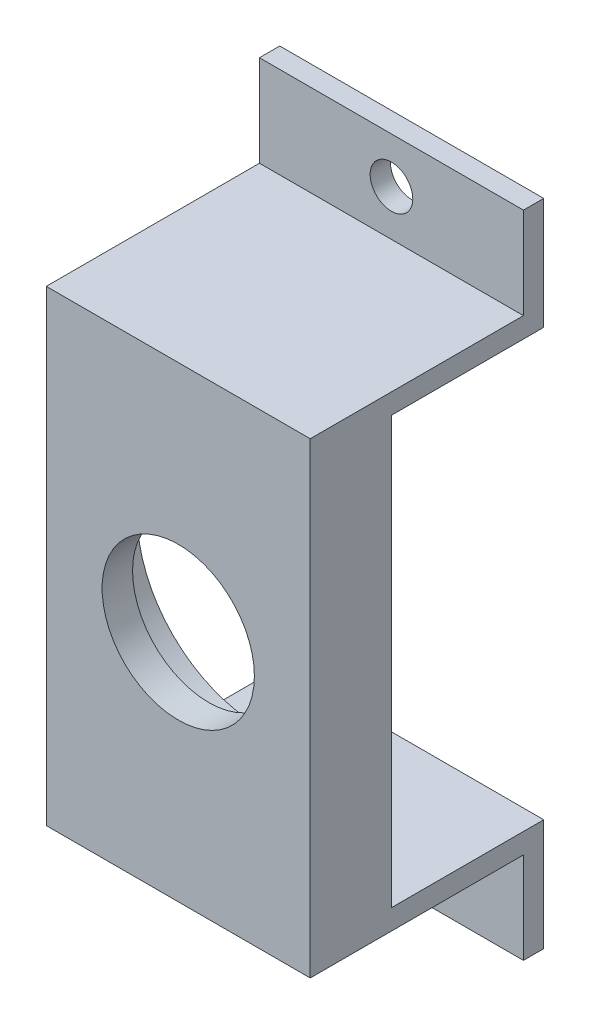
ISO-10303-21;
HEADER;
FILE_DESCRIPTION(('STEP AP214'),'2;1');
FILE_NAME('part.step','',(''),(''),'','','');
FILE_SCHEMA(('AUTOMOTIVE_DESIGN { 1 0 10303 214 1 1 1 1 }'));
ENDSEC;
DATA;
#1=APPLICATION_CONTEXT('core data for automotive mechanical design processes');
#2=APPLICATION_PROTOCOL_DEFINITION('international standard','automotive_design',2000,#1);
#3=PRODUCT_CONTEXT('',#1,'mechanical');
#4=PRODUCT('Part','Part','',(#3));
#5=PRODUCT_RELATED_PRODUCT_CATEGORY('part','',(#4));
#6=PRODUCT_DEFINITION_FORMATION('','',#4);
#7=PRODUCT_DEFINITION_CONTEXT('part definition',#1,'design');
#8=PRODUCT_DEFINITION('design','',#6,#7);
#9=PRODUCT_DEFINITION_SHAPE('','',#8);
#10=(LENGTH_UNIT() NAMED_UNIT(*) SI_UNIT(.MILLI.,.METRE.));
#11=(NAMED_UNIT(*) PLANE_ANGLE_UNIT() SI_UNIT($,.RADIAN.));
#12=(NAMED_UNIT(*) SI_UNIT($,.STERADIAN.) SOLID_ANGLE_UNIT());
#13=UNCERTAINTY_MEASURE_WITH_UNIT(LENGTH_MEASURE(1.E-05),#10,'distance_accuracy_value','');
#14=(GEOMETRIC_REPRESENTATION_CONTEXT(3) GLOBAL_UNCERTAINTY_ASSIGNED_CONTEXT((#13)) GLOBAL_UNIT_ASSIGNED_CONTEXT((#10,
#11,#12)) REPRESENTATION_CONTEXT('',''));
#15=CARTESIAN_POINT('',(0.,0.,0.));
#16=DIRECTION('',(0.,0.,1.));
#17=DIRECTION('',(1.,0.,0.));
#18=AXIS2_PLACEMENT_3D('',#15,#16,#17);
#19=CARTESIAN_POINT('',(0.,0.,17.));
#20=DIRECTION('',(0.,0.,1.));
#21=DIRECTION('',(1.,0.,0.));
#22=AXIS2_PLACEMENT_3D('',#19,#20,#21);
#23=PLANE('',#22);
#24=CARTESIAN_POINT('',(0.,0.,17.));
#25=DIRECTION('',(0.,0.,-1.));
#26=DIRECTION('',(-1.,0.,0.));
#27=AXIS2_PLACEMENT_3D('',#24,#25,#26);
#28=CIRCLE('',#27,12.05);
#29=CARTESIAN_POINT('',(-12.05,0.,17.));
#30=VERTEX_POINT('',#29);
#31=EDGE_CURVE('E156',#30,#30,#28,.T.);
#32=ORIENTED_EDGE('',*,*,#31,.F.);
#33=EDGE_LOOP('',(#32));
#34=FACE_BOUND('',#33,.T.);
#35=DIRECTION('',(0.,1.,0.));
#36=VECTOR('',#35,1.);
#37=CARTESIAN_POINT('',(13.,-21.,17.));
#38=LINE('',#37,#36);
#39=CARTESIAN_POINT('',(13.,-21.,17.));
#40=VERTEX_POINT('',#39);
#41=CARTESIAN_POINT('',(13.,21.,17.));
#42=VERTEX_POINT('',#41);
#43=EDGE_CURVE('E175',#40,#42,#38,.T.);
#44=ORIENTED_EDGE('',*,*,#43,.F.);
#45=DIRECTION('',(1.,0.,0.));
#46=VECTOR('',#45,1.);
#47=CARTESIAN_POINT('',(15.,-21.,17.));
#48=LINE('',#47,#46);
#49=CARTESIAN_POINT('',(-13.,-21.,17.));
#50=VERTEX_POINT('',#49);
#51=EDGE_CURVE('E178',#50,#40,#48,.T.);
#52=ORIENTED_EDGE('',*,*,#51,.F.);
#53=DIRECTION('',(0.,-1.,0.));
#54=VECTOR('',#53,1.);
#55=CARTESIAN_POINT('',(-13.,21.,17.));
#56=LINE('',#55,#54);
#57=CARTESIAN_POINT('',(-13.,21.,17.));
#58=VERTEX_POINT('',#57);
#59=EDGE_CURVE('E230',#58,#50,#56,.T.);
#60=ORIENTED_EDGE('',*,*,#59,.F.);
#61=DIRECTION('',(-1.,0.,0.));
#62=VECTOR('',#61,1.);
#63=CARTESIAN_POINT('',(15.,21.,17.));
#64=LINE('',#63,#62);
#65=EDGE_CURVE('E158',#42,#58,#64,.T.);
#66=ORIENTED_EDGE('',*,*,#65,.F.);
#67=EDGE_LOOP('',(#44,#52,#60,#66));
#68=FACE_BOUND('',#67,.T.);
#69=ADVANCED_FACE('F43',(#34,#68),#23,.F.);
#70=CARTESIAN_POINT('',(0.,0.,25.));
#71=DIRECTION('',(0.,0.,1.));
#72=DIRECTION('',(1.,0.,0.));
#73=AXIS2_PLACEMENT_3D('',#70,#71,#72);
#74=PLANE('',#73);
#75=CARTESIAN_POINT('',(0.,0.,25.));
#76=DIRECTION('',(0.,0.,1.));
#77=DIRECTION('',(1.,0.,0.));
#78=AXIS2_PLACEMENT_3D('',#75,#76,#77);
#79=CIRCLE('',#78,7.5);
#80=CARTESIAN_POINT('',(7.5,0.,25.));
#81=VERTEX_POINT('',#80);
#82=EDGE_CURVE('E11',#81,#81,#79,.T.);
#83=ORIENTED_EDGE('',*,*,#82,.F.);
#84=EDGE_LOOP('',(#83));
#85=FACE_BOUND('',#84,.T.);
#86=DIRECTION('',(-1.,0.,0.));
#87=VECTOR('',#86,1.);
#88=CARTESIAN_POINT('',(15.,-23.,25.));
#89=LINE('',#88,#87);
#90=CARTESIAN_POINT('',(13.,-23.,25.));
#91=VERTEX_POINT('',#90);
#92=CARTESIAN_POINT('',(-13.,-23.,25.));
#93=VERTEX_POINT('',#92);
#94=EDGE_CURVE('E148',#91,#93,#89,.T.);
#95=ORIENTED_EDGE('',*,*,#94,.F.);
#96=DIRECTION('',(0.,-1.,0.));
#97=VECTOR('',#96,1.);
#98=CARTESIAN_POINT('',(13.,23.,25.));
#99=LINE('',#98,#97);
#100=CARTESIAN_POINT('',(13.,23.,25.));
#101=VERTEX_POINT('',#100);
#102=EDGE_CURVE('E133',#101,#91,#99,.T.);
#103=ORIENTED_EDGE('',*,*,#102,.F.);
#104=DIRECTION('',(1.,0.,0.));
#105=VECTOR('',#104,1.);
#106=CARTESIAN_POINT('',(-15.,23.,25.));
#107=LINE('',#106,#105);
#108=CARTESIAN_POINT('',(-13.,23.,25.));
#109=VERTEX_POINT('',#108);
#110=EDGE_CURVE('E147',#109,#101,#107,.T.);
#111=ORIENTED_EDGE('',*,*,#110,.F.);
#112=DIRECTION('',(0.,1.,0.));
#113=VECTOR('',#112,1.);
#114=CARTESIAN_POINT('',(-13.,-23.,25.));
#115=LINE('',#114,#113);
#116=EDGE_CURVE('E244',#93,#109,#115,.T.);
#117=ORIENTED_EDGE('',*,*,#116,.F.);
#118=EDGE_LOOP('',(#95,#103,#111,#117));
#119=FACE_BOUND('',#118,.T.);
#120=ADVANCED_FACE('F145',(#85,#119),#74,.T.);
#121=CARTESIAN_POINT('',(0.,-23.,0.));
#122=DIRECTION('',(0.,-1.,0.));
#123=DIRECTION('',(0.,0.,-1.));
#124=AXIS2_PLACEMENT_3D('',#121,#122,#123);
#125=PLANE('',#124);
#126=DIRECTION('',(-1.,0.,0.));
#127=VECTOR('',#126,1.);
#128=CARTESIAN_POINT('',(-15.,-23.,4.));
#129=LINE('',#128,#127);
#130=CARTESIAN_POINT('',(13.,-23.,4.));
#131=VERTEX_POINT('',#130);
#132=CARTESIAN_POINT('',(-13.,-23.,4.));
#133=VERTEX_POINT('',#132);
#134=EDGE_CURVE('E202',#131,#133,#129,.T.);
#135=ORIENTED_EDGE('',*,*,#134,.F.);
#136=DIRECTION('',(0.,0.,-1.));
#137=VECTOR('',#136,1.);
#138=CARTESIAN_POINT('',(13.,-23.,25.));
#139=LINE('',#138,#137);
#140=EDGE_CURVE('E149',#91,#131,#139,.T.);
#141=ORIENTED_EDGE('',*,*,#140,.F.);
#142=ORIENTED_EDGE('',*,*,#94,.T.);
#143=DIRECTION('',(0.,0.,1.));
#144=VECTOR('',#143,1.);
#145=CARTESIAN_POINT('',(-13.,-23.,4.));
#146=LINE('',#145,#144);
#147=EDGE_CURVE('E220',#133,#93,#146,.T.);
#148=ORIENTED_EDGE('',*,*,#147,.F.);
#149=EDGE_LOOP('',(#135,#141,#142,#148));
#150=FACE_BOUND('',#149,.T.);
#151=ADVANCED_FACE('F265',(#150),#125,.T.);
#152=CARTESIAN_POINT('',(0.,23.,0.));
#153=DIRECTION('',(0.,1.,0.));
#154=DIRECTION('',(0.,0.,1.));
#155=AXIS2_PLACEMENT_3D('',#152,#153,#154);
#156=PLANE('',#155);
#157=ORIENTED_EDGE('',*,*,#110,.T.);
#158=DIRECTION('',(0.,0.,1.));
#159=VECTOR('',#158,1.);
#160=CARTESIAN_POINT('',(13.,23.,4.));
#161=LINE('',#160,#159);
#162=CARTESIAN_POINT('',(13.,23.,4.));
#163=VERTEX_POINT('',#162);
#164=EDGE_CURVE('E130',#163,#101,#161,.T.);
#165=ORIENTED_EDGE('',*,*,#164,.F.);
#166=DIRECTION('',(1.,0.,0.));
#167=VECTOR('',#166,1.);
#168=CARTESIAN_POINT('',(-15.,23.,4.));
#169=LINE('',#168,#167);
#170=CARTESIAN_POINT('',(-13.,23.,4.));
#171=VERTEX_POINT('',#170);
#172=EDGE_CURVE('E195',#171,#163,#169,.T.);
#173=ORIENTED_EDGE('',*,*,#172,.F.);
#174=DIRECTION('',(0.,0.,-1.));
#175=VECTOR('',#174,1.);
#176=CARTESIAN_POINT('',(-13.,23.,25.));
#177=LINE('',#176,#175);
#178=EDGE_CURVE('E153',#109,#171,#177,.T.);
#179=ORIENTED_EDGE('',*,*,#178,.F.);
#180=EDGE_LOOP('',(#157,#165,#173,#179));
#181=FACE_BOUND('',#180,.T.);
#182=ADVANCED_FACE('F152',(#181),#156,.T.);
#183=CARTESIAN_POINT('',(15.,21.,2.));
#184=DIRECTION('',(0.,1.,0.));
#185=DIRECTION('',(0.,0.,1.));
#186=AXIS2_PLACEMENT_3D('',#183,#184,#185);
#187=PLANE('',#186);
#188=DIRECTION('',(0.,0.,-1.));
#189=VECTOR('',#188,1.);
#190=CARTESIAN_POINT('',(13.,21.,17.));
#191=LINE('',#190,#189);
#192=CARTESIAN_POINT('',(13.,21.,2.));
#193=VERTEX_POINT('',#192);
#194=EDGE_CURVE('E180',#42,#193,#191,.T.);
#195=ORIENTED_EDGE('',*,*,#194,.F.);
#196=ORIENTED_EDGE('',*,*,#65,.T.);
#197=DIRECTION('',(0.,0.,1.));
#198=VECTOR('',#197,1.);
#199=CARTESIAN_POINT('',(-13.,21.,2.));
#200=LINE('',#199,#198);
#201=CARTESIAN_POINT('',(-13.,21.,2.));
#202=VERTEX_POINT('',#201);
#203=EDGE_CURVE('E232',#202,#58,#200,.T.);
#204=ORIENTED_EDGE('',*,*,#203,.F.);
#205=DIRECTION('',(-1.,0.,0.));
#206=VECTOR('',#205,1.);
#207=CARTESIAN_POINT('',(15.,21.,2.));
#208=LINE('',#207,#206);
#209=EDGE_CURVE('E154',#193,#202,#208,.T.);
#210=ORIENTED_EDGE('',*,*,#209,.F.);
#211=EDGE_LOOP('',(#195,#196,#204,#210));
#212=FACE_BOUND('',#211,.T.);
#213=ADVANCED_FACE('F289',(#212),#187,.F.);
#214=CARTESIAN_POINT('',(0.,0.,2.));
#215=DIRECTION('',(0.,0.,-1.));
#216=DIRECTION('',(-1.,0.,0.));
#217=AXIS2_PLACEMENT_3D('',#214,#215,#216);
#218=PLANE('',#217);
#219=CARTESIAN_POINT('',(0.,27.5,2.));
#220=DIRECTION('',(0.,0.,1.));
#221=DIRECTION('',(1.,0.,0.));
#222=AXIS2_PLACEMENT_3D('',#219,#220,#221);
#223=CIRCLE('',#222,2.1);
#224=CARTESIAN_POINT('',(2.1,27.5,2.));
#225=VERTEX_POINT('',#224);
#226=EDGE_CURVE('E214',#225,#225,#223,.T.);
#227=ORIENTED_EDGE('',*,*,#226,.T.);
#228=EDGE_LOOP('',(#227));
#229=FACE_BOUND('',#228,.T.);
#230=DIRECTION('',(-1.,0.,0.));
#231=VECTOR('',#230,1.);
#232=CARTESIAN_POINT('',(-15.,32.,2.));
#233=LINE('',#232,#231);
#234=CARTESIAN_POINT('',(13.,32.,2.));
#235=VERTEX_POINT('',#234);
#236=CARTESIAN_POINT('',(-13.,32.,2.));
#237=VERTEX_POINT('',#236);
#238=EDGE_CURVE('E192',#235,#237,#233,.T.);
#239=ORIENTED_EDGE('',*,*,#238,.F.);
#240=DIRECTION('',(0.,1.,0.));
#241=VECTOR('',#240,1.);
#242=CARTESIAN_POINT('',(13.,21.,2.));
#243=LINE('',#242,#241);
#244=EDGE_CURVE('E249',#193,#235,#243,.T.);
#245=ORIENTED_EDGE('',*,*,#244,.F.);
#246=ORIENTED_EDGE('',*,*,#209,.T.);
#247=DIRECTION('',(0.,-1.,0.));
#248=VECTOR('',#247,1.);
#249=CARTESIAN_POINT('',(-13.,32.,2.));
#250=LINE('',#249,#248);
#251=EDGE_CURVE('E235',#237,#202,#250,.T.);
#252=ORIENTED_EDGE('',*,*,#251,.F.);
#253=EDGE_LOOP('',(#239,#245,#246,#252));
#254=FACE_BOUND('',#253,.T.);
#255=ADVANCED_FACE('F284',(#229,#254),#218,.T.);
#256=CARTESIAN_POINT('',(15.,-21.,2.));
#257=DIRECTION('',(0.,-1.,0.));
#258=DIRECTION('',(0.,0.,-1.));
#259=AXIS2_PLACEMENT_3D('',#256,#257,#258);
#260=PLANE('',#259);
#261=DIRECTION('',(0.,0.,1.));
#262=VECTOR('',#261,1.);
#263=CARTESIAN_POINT('',(13.,-21.,2.));
#264=LINE('',#263,#262);
#265=CARTESIAN_POINT('',(13.,-21.,2.));
#266=VERTEX_POINT('',#265);
#267=EDGE_CURVE('E181',#266,#40,#264,.T.);
#268=ORIENTED_EDGE('',*,*,#267,.F.);
#269=DIRECTION('',(1.,0.,0.));
#270=VECTOR('',#269,1.);
#271=CARTESIAN_POINT('',(15.,-21.,2.));
#272=LINE('',#271,#270);
#273=CARTESIAN_POINT('',(-13.,-21.,2.));
#274=VERTEX_POINT('',#273);
#275=EDGE_CURVE('E190',#274,#266,#272,.T.);
#276=ORIENTED_EDGE('',*,*,#275,.F.);
#277=DIRECTION('',(0.,0.,-1.));
#278=VECTOR('',#277,1.);
#279=CARTESIAN_POINT('',(-13.,-21.,17.));
#280=LINE('',#279,#278);
#281=EDGE_CURVE('E189',#50,#274,#280,.T.);
#282=ORIENTED_EDGE('',*,*,#281,.F.);
#283=ORIENTED_EDGE('',*,*,#51,.T.);
#284=EDGE_LOOP('',(#268,#276,#282,#283));
#285=FACE_BOUND('',#284,.T.);
#286=ADVANCED_FACE('F186',(#285),#260,.F.);
#287=CARTESIAN_POINT('',(0.,0.,2.));
#288=DIRECTION('',(0.,0.,-1.));
#289=DIRECTION('',(-1.,0.,0.));
#290=AXIS2_PLACEMENT_3D('',#287,#288,#289);
#291=PLANE('',#290);
#292=CARTESIAN_POINT('',(0.,-27.5,2.));
#293=DIRECTION('',(0.,0.,1.));
#294=DIRECTION('',(1.,0.,0.));
#295=AXIS2_PLACEMENT_3D('',#292,#293,#294);
#296=CIRCLE('',#295,2.1);
#297=CARTESIAN_POINT('',(2.1,-27.5,2.));
#298=VERTEX_POINT('',#297);
#299=EDGE_CURVE('E205',#298,#298,#296,.T.);
#300=ORIENTED_EDGE('',*,*,#299,.T.);
#301=EDGE_LOOP('',(#300));
#302=FACE_BOUND('',#301,.T.);
#303=ORIENTED_EDGE('',*,*,#275,.T.);
#304=DIRECTION('',(0.,1.,0.));
#305=VECTOR('',#304,1.);
#306=CARTESIAN_POINT('',(13.,-32.,2.));
#307=LINE('',#306,#305);
#308=CARTESIAN_POINT('',(13.,-32.,2.));
#309=VERTEX_POINT('',#308);
#310=EDGE_CURVE('E253',#309,#266,#307,.T.);
#311=ORIENTED_EDGE('',*,*,#310,.F.);
#312=DIRECTION('',(1.,0.,0.));
#313=VECTOR('',#312,1.);
#314=CARTESIAN_POINT('',(-15.,-32.,2.));
#315=LINE('',#314,#313);
#316=CARTESIAN_POINT('',(-13.,-32.,2.));
#317=VERTEX_POINT('',#316);
#318=EDGE_CURVE('E204',#317,#309,#315,.T.);
#319=ORIENTED_EDGE('',*,*,#318,.F.);
#320=DIRECTION('',(0.,-1.,0.));
#321=VECTOR('',#320,1.);
#322=CARTESIAN_POINT('',(-13.,-21.,2.));
#323=LINE('',#322,#321);
#324=EDGE_CURVE('E65',#274,#317,#323,.T.);
#325=ORIENTED_EDGE('',*,*,#324,.F.);
#326=EDGE_LOOP('',(#303,#311,#319,#325));
#327=FACE_BOUND('',#326,.T.);
#328=ADVANCED_FACE('F272',(#302,#327),#291,.T.);
#329=CARTESIAN_POINT('',(-15.,32.,4.));
#330=DIRECTION('',(0.,0.,-1.));
#331=DIRECTION('',(-1.,0.,0.));
#332=AXIS2_PLACEMENT_3D('',#329,#330,#331);
#333=PLANE('',#332);
#334=CARTESIAN_POINT('',(0.,27.5,4.));
#335=DIRECTION('',(0.,0.,1.));
#336=DIRECTION('',(1.,0.,0.));
#337=AXIS2_PLACEMENT_3D('',#334,#335,#336);
#338=CIRCLE('',#337,2.09999999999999);
#339=CARTESIAN_POINT('',(2.09999999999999,27.5,4.));
#340=VERTEX_POINT('',#339);
#341=EDGE_CURVE('E217',#340,#340,#338,.T.);
#342=ORIENTED_EDGE('',*,*,#341,.F.);
#343=EDGE_LOOP('',(#342));
#344=FACE_BOUND('',#343,.T.);
#345=DIRECTION('',(0.,-1.,0.));
#346=VECTOR('',#345,1.);
#347=CARTESIAN_POINT('',(13.,32.,4.));
#348=LINE('',#347,#346);
#349=CARTESIAN_POINT('',(13.,32.,4.));
#350=VERTEX_POINT('',#349);
#351=EDGE_CURVE('E136',#350,#163,#348,.T.);
#352=ORIENTED_EDGE('',*,*,#351,.F.);
#353=DIRECTION('',(1.,0.,0.));
#354=VECTOR('',#353,1.);
#355=CARTESIAN_POINT('',(-15.,32.,4.));
#356=LINE('',#355,#354);
#357=CARTESIAN_POINT('',(-13.,32.,4.));
#358=VERTEX_POINT('',#357);
#359=EDGE_CURVE('E197',#358,#350,#356,.T.);
#360=ORIENTED_EDGE('',*,*,#359,.F.);
#361=DIRECTION('',(0.,1.,0.));
#362=VECTOR('',#361,1.);
#363=CARTESIAN_POINT('',(-13.,23.,4.));
#364=LINE('',#363,#362);
#365=EDGE_CURVE('E241',#171,#358,#364,.T.);
#366=ORIENTED_EDGE('',*,*,#365,.F.);
#367=ORIENTED_EDGE('',*,*,#172,.T.);
#368=EDGE_LOOP('',(#352,#360,#366,#367));
#369=FACE_BOUND('',#368,.T.);
#370=ADVANCED_FACE('F274',(#344,#369),#333,.F.);
#371=CARTESIAN_POINT('',(0.,32.,0.));
#372=DIRECTION('',(0.,1.,0.));
#373=DIRECTION('',(0.,0.,1.));
#374=AXIS2_PLACEMENT_3D('',#371,#372,#373);
#375=PLANE('',#374);
#376=ORIENTED_EDGE('',*,*,#359,.T.);
#377=DIRECTION('',(0.,0.,1.));
#378=VECTOR('',#377,1.);
#379=CARTESIAN_POINT('',(13.,32.,2.));
#380=LINE('',#379,#378);
#381=EDGE_CURVE('E247',#235,#350,#380,.T.);
#382=ORIENTED_EDGE('',*,*,#381,.F.);
#383=ORIENTED_EDGE('',*,*,#238,.T.);
#384=DIRECTION('',(0.,0.,-1.));
#385=VECTOR('',#384,1.);
#386=CARTESIAN_POINT('',(-13.,32.,4.));
#387=LINE('',#386,#385);
#388=EDGE_CURVE('E238',#358,#237,#387,.T.);
#389=ORIENTED_EDGE('',*,*,#388,.F.);
#390=EDGE_LOOP('',(#376,#382,#383,#389));
#391=FACE_BOUND('',#390,.T.);
#392=ADVANCED_FACE('F281',(#391),#375,.T.);
#393=CARTESIAN_POINT('',(-15.,-32.,4.));
#394=DIRECTION('',(0.,0.,-1.));
#395=DIRECTION('',(-1.,0.,0.));
#396=AXIS2_PLACEMENT_3D('',#393,#394,#395);
#397=PLANE('',#396);
#398=CARTESIAN_POINT('',(0.,-27.5,4.));
#399=DIRECTION('',(0.,0.,1.));
#400=DIRECTION('',(1.,0.,0.));
#401=AXIS2_PLACEMENT_3D('',#398,#399,#400);
#402=CIRCLE('',#401,2.09999999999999);
#403=CARTESIAN_POINT('',(2.09999999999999,-27.5,4.));
#404=VERTEX_POINT('',#403);
#405=EDGE_CURVE('E211',#404,#404,#402,.T.);
#406=ORIENTED_EDGE('',*,*,#405,.F.);
#407=EDGE_LOOP('',(#406));
#408=FACE_BOUND('',#407,.T.);
#409=DIRECTION('',(0.,-1.,0.));
#410=VECTOR('',#409,1.);
#411=CARTESIAN_POINT('',(13.,-23.,4.));
#412=LINE('',#411,#410);
#413=CARTESIAN_POINT('',(13.,-32.,4.));
#414=VERTEX_POINT('',#413);
#415=EDGE_CURVE('E57',#131,#414,#412,.T.);
#416=ORIENTED_EDGE('',*,*,#415,.F.);
#417=ORIENTED_EDGE('',*,*,#134,.T.);
#418=DIRECTION('',(0.,1.,0.));
#419=VECTOR('',#418,1.);
#420=CARTESIAN_POINT('',(-13.,-32.,4.));
#421=LINE('',#420,#419);
#422=CARTESIAN_POINT('',(-13.,-32.,4.));
#423=VERTEX_POINT('',#422);
#424=EDGE_CURVE('E223',#423,#133,#421,.T.);
#425=ORIENTED_EDGE('',*,*,#424,.F.);
#426=DIRECTION('',(-1.,0.,0.));
#427=VECTOR('',#426,1.);
#428=CARTESIAN_POINT('',(-15.,-32.,4.));
#429=LINE('',#428,#427);
#430=EDGE_CURVE('E198',#414,#423,#429,.T.);
#431=ORIENTED_EDGE('',*,*,#430,.F.);
#432=EDGE_LOOP('',(#416,#417,#425,#431));
#433=FACE_BOUND('',#432,.T.);
#434=ADVANCED_FACE('F262',(#408,#433),#397,.F.);
#435=CARTESIAN_POINT('',(0.,-32.,0.));
#436=DIRECTION('',(0.,-1.,0.));
#437=DIRECTION('',(0.,0.,-1.));
#438=AXIS2_PLACEMENT_3D('',#435,#436,#437);
#439=PLANE('',#438);
#440=ORIENTED_EDGE('',*,*,#318,.T.);
#441=DIRECTION('',(0.,0.,-1.));
#442=VECTOR('',#441,1.);
#443=CARTESIAN_POINT('',(13.,-32.,4.));
#444=LINE('',#443,#442);
#445=EDGE_CURVE('E255',#414,#309,#444,.T.);
#446=ORIENTED_EDGE('',*,*,#445,.F.);
#447=ORIENTED_EDGE('',*,*,#430,.T.);
#448=DIRECTION('',(0.,0.,1.));
#449=VECTOR('',#448,1.);
#450=CARTESIAN_POINT('',(-13.,-32.,2.));
#451=LINE('',#450,#449);
#452=EDGE_CURVE('E226',#317,#423,#451,.T.);
#453=ORIENTED_EDGE('',*,*,#452,.F.);
#454=EDGE_LOOP('',(#440,#446,#447,#453));
#455=FACE_BOUND('',#454,.T.);
#456=ADVANCED_FACE('F269',(#455),#439,.T.);
#457=CARTESIAN_POINT('',(0.,0.,17.));
#458=DIRECTION('',(0.,0.,1.));
#459=DIRECTION('',(1.,0.,0.));
#460=AXIS2_PLACEMENT_3D('',#457,#458,#459);
#461=CYLINDRICAL_SURFACE('',#460,7.5);
#462=ORIENTED_EDGE('',*,*,#82,.T.);
#463=EDGE_LOOP('',(#462));
#464=FACE_BOUND('',#463,.T.);
#465=CARTESIAN_POINT('',(0.,0.,22.));
#466=DIRECTION('',(0.,0.,-1.));
#467=DIRECTION('',(-1.,0.,0.));
#468=AXIS2_PLACEMENT_3D('',#465,#466,#467);
#469=CIRCLE('',#468,7.5);
#470=CARTESIAN_POINT('',(-7.5,0.,22.));
#471=VERTEX_POINT('',#470);
#472=EDGE_CURVE('E46',#471,#471,#469,.F.);
#473=ORIENTED_EDGE('',*,*,#472,.F.);
#474=EDGE_LOOP('',(#473));
#475=FACE_BOUND('',#474,.T.);
#476=ADVANCED_FACE('F301',(#464,#475),#461,.F.);
#477=CARTESIAN_POINT('',(0.,0.,22.));
#478=DIRECTION('',(0.,0.,-1.));
#479=DIRECTION('',(-1.,0.,0.));
#480=AXIS2_PLACEMENT_3D('',#477,#478,#479);
#481=PLANE('',#480);
#482=CARTESIAN_POINT('',(0.,0.,22.));
#483=DIRECTION('',(0.,0.,-1.));
#484=DIRECTION('',(-1.,0.,0.));
#485=AXIS2_PLACEMENT_3D('',#482,#483,#484);
#486=CIRCLE('',#485,12.05);
#487=CARTESIAN_POINT('',(-12.05,0.,22.));
#488=VERTEX_POINT('',#487);
#489=EDGE_CURVE('E162',#488,#488,#486,.T.);
#490=ORIENTED_EDGE('',*,*,#489,.T.);
#491=EDGE_LOOP('',(#490));
#492=FACE_BOUND('',#491,.T.);
#493=ORIENTED_EDGE('',*,*,#472,.T.);
#494=EDGE_LOOP('',(#493));
#495=FACE_BOUND('',#494,.T.);
#496=ADVANCED_FACE('F298',(#492,#495),#481,.T.);
#497=CARTESIAN_POINT('',(0.,0.,22.));
#498=DIRECTION('',(0.,0.,-1.));
#499=DIRECTION('',(-1.,0.,0.));
#500=AXIS2_PLACEMENT_3D('',#497,#498,#499);
#501=CYLINDRICAL_SURFACE('',#500,12.05);
#502=ORIENTED_EDGE('',*,*,#489,.F.);
#503=EDGE_LOOP('',(#502));
#504=FACE_BOUND('',#503,.T.);
#505=ORIENTED_EDGE('',*,*,#31,.T.);
#506=EDGE_LOOP('',(#505));
#507=FACE_BOUND('',#506,.T.);
#508=ADVANCED_FACE('F168',(#504,#507),#501,.F.);
#509=CARTESIAN_POINT('',(0.,-27.5,4.));
#510=DIRECTION('',(0.,0.,1.));
#511=DIRECTION('',(1.,0.,0.));
#512=AXIS2_PLACEMENT_3D('',#509,#510,#511);
#513=CYLINDRICAL_SURFACE('',#512,2.09999999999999);
#514=ORIENTED_EDGE('',*,*,#299,.F.);
#515=EDGE_LOOP('',(#514));
#516=FACE_BOUND('',#515,.T.);
#517=ORIENTED_EDGE('',*,*,#405,.T.);
#518=EDGE_LOOP('',(#517));
#519=FACE_BOUND('',#518,.T.);
#520=ADVANCED_FACE('F305',(#516,#519),#513,.F.);
#521=CARTESIAN_POINT('',(0.,27.5,4.));
#522=DIRECTION('',(0.,0.,1.));
#523=DIRECTION('',(1.,0.,0.));
#524=AXIS2_PLACEMENT_3D('',#521,#522,#523);
#525=CYLINDRICAL_SURFACE('',#524,2.09999999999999);
#526=ORIENTED_EDGE('',*,*,#226,.F.);
#527=EDGE_LOOP('',(#526));
#528=FACE_BOUND('',#527,.T.);
#529=ORIENTED_EDGE('',*,*,#341,.T.);
#530=EDGE_LOOP('',(#529));
#531=FACE_BOUND('',#530,.T.);
#532=ADVANCED_FACE('F391',(#528,#531),#525,.F.);
#533=CARTESIAN_POINT('',(-13.,0.,0.));
#534=DIRECTION('',(-1.,0.,0.));
#535=DIRECTION('',(0.,0.,1.));
#536=AXIS2_PLACEMENT_3D('',#533,#534,#535);
#537=PLANE('',#536);
#538=ORIENTED_EDGE('',*,*,#116,.T.);
#539=ORIENTED_EDGE('',*,*,#178,.T.);
#540=ORIENTED_EDGE('',*,*,#365,.T.);
#541=ORIENTED_EDGE('',*,*,#388,.T.);
#542=ORIENTED_EDGE('',*,*,#251,.T.);
#543=ORIENTED_EDGE('',*,*,#203,.T.);
#544=ORIENTED_EDGE('',*,*,#59,.T.);
#545=ORIENTED_EDGE('',*,*,#281,.T.);
#546=ORIENTED_EDGE('',*,*,#324,.T.);
#547=ORIENTED_EDGE('',*,*,#452,.T.);
#548=ORIENTED_EDGE('',*,*,#424,.T.);
#549=ORIENTED_EDGE('',*,*,#147,.T.);
#550=EDGE_LOOP('',(#538,#539,#540,#541,#542,#543,#544,#545,#546,#547,#548,#549));
#551=FACE_BOUND('',#550,.T.);
#552=ADVANCED_FACE('F266',(#551),#537,.T.);
#553=CARTESIAN_POINT('',(13.,0.,0.));
#554=DIRECTION('',(1.,0.,0.));
#555=DIRECTION('',(0.,0.,-1.));
#556=AXIS2_PLACEMENT_3D('',#553,#554,#555);
#557=PLANE('',#556);
#558=ORIENTED_EDGE('',*,*,#164,.T.);
#559=ORIENTED_EDGE('',*,*,#102,.T.);
#560=ORIENTED_EDGE('',*,*,#140,.T.);
#561=ORIENTED_EDGE('',*,*,#415,.T.);
#562=ORIENTED_EDGE('',*,*,#445,.T.);
#563=ORIENTED_EDGE('',*,*,#310,.T.);
#564=ORIENTED_EDGE('',*,*,#267,.T.);
#565=ORIENTED_EDGE('',*,*,#43,.T.);
#566=ORIENTED_EDGE('',*,*,#194,.T.);
#567=ORIENTED_EDGE('',*,*,#244,.T.);
#568=ORIENTED_EDGE('',*,*,#381,.T.);
#569=ORIENTED_EDGE('',*,*,#351,.T.);
#570=EDGE_LOOP('',(#558,#559,#560,#561,#562,#563,#564,#565,#566,#567,#568,#569));
#571=FACE_BOUND('',#570,.T.);
#572=ADVANCED_FACE('F132',(#571),#557,.T.);
#573=CLOSED_SHELL('',(#69,#120,#151,#182,#213,#255,#286,#328,#370,#392,#434,#456,#476,#496,#508,
#520,#532,#552,#572));
#574=MANIFOLD_SOLID_BREP('B2',#573);
#575=ADVANCED_BREP_SHAPE_REPRESENTATION('',(#18,#574),#14);
#576=SHAPE_DEFINITION_REPRESENTATION(#9,#575);
ENDSEC;
END-ISO-10303-21;
